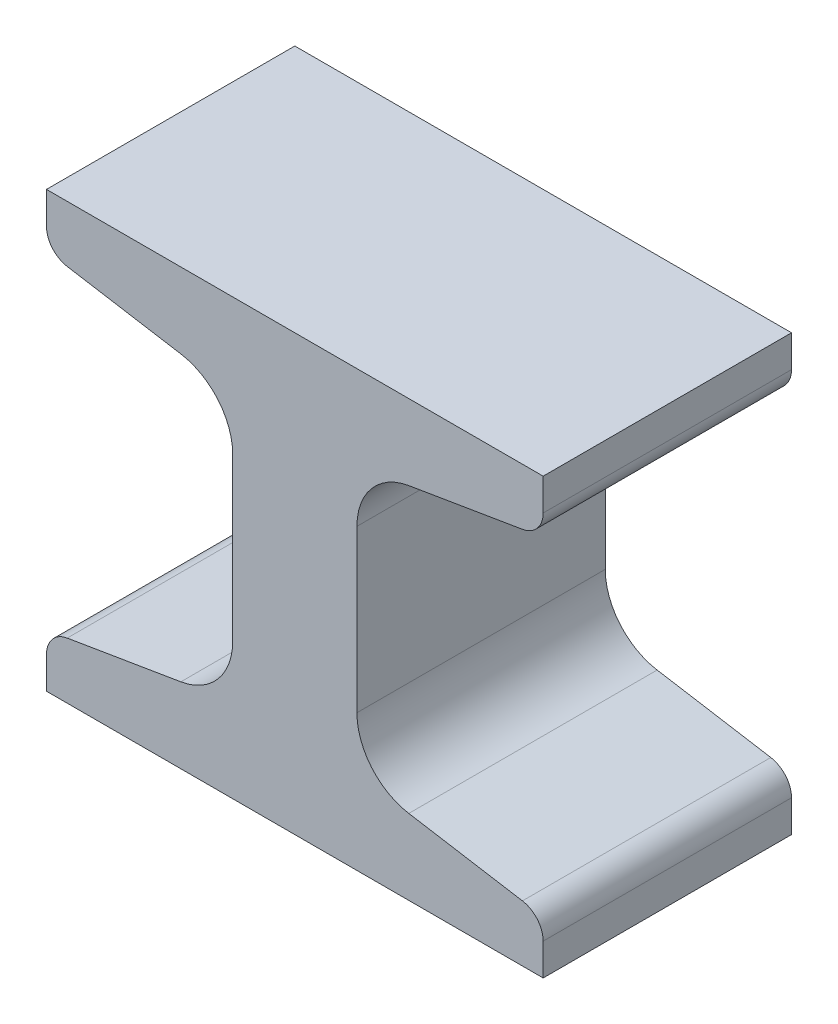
ISO-10303-21;
HEADER;
FILE_DESCRIPTION(('STEP AP214'),'2;1');
FILE_NAME('part.step','',(''),(''),'','','');
FILE_SCHEMA(('AUTOMOTIVE_DESIGN { 1 0 10303 214 1 1 1 1 }'));
ENDSEC;
DATA;
#1=APPLICATION_CONTEXT('core data for automotive mechanical design processes');
#2=APPLICATION_PROTOCOL_DEFINITION('international standard','automotive_design',2000,#1);
#3=PRODUCT_CONTEXT('',#1,'mechanical');
#4=PRODUCT('Part','Part','',(#3));
#5=PRODUCT_RELATED_PRODUCT_CATEGORY('part','',(#4));
#6=PRODUCT_DEFINITION_FORMATION('','',#4);
#7=PRODUCT_DEFINITION_CONTEXT('part definition',#1,'design');
#8=PRODUCT_DEFINITION('design','',#6,#7);
#9=PRODUCT_DEFINITION_SHAPE('','',#8);
#10=(LENGTH_UNIT() NAMED_UNIT(*) SI_UNIT(.MILLI.,.METRE.));
#11=(NAMED_UNIT(*) PLANE_ANGLE_UNIT() SI_UNIT($,.RADIAN.));
#12=(NAMED_UNIT(*) SI_UNIT($,.STERADIAN.) SOLID_ANGLE_UNIT());
#13=UNCERTAINTY_MEASURE_WITH_UNIT(LENGTH_MEASURE(1.E-05),#10,'distance_accuracy_value','');
#14=(GEOMETRIC_REPRESENTATION_CONTEXT(3) GLOBAL_UNCERTAINTY_ASSIGNED_CONTEXT((#13)) GLOBAL_UNIT_ASSIGNED_CONTEXT((#10,
#11,#12)) REPRESENTATION_CONTEXT('',''));
#15=CARTESIAN_POINT('',(0.,0.,0.));
#16=DIRECTION('',(0.,0.,1.));
#17=DIRECTION('',(1.,0.,0.));
#18=AXIS2_PLACEMENT_3D('',#15,#16,#17);
#19=CARTESIAN_POINT('',(50.8,0.,12.7));
#20=DIRECTION('',(0.,-1.,0.));
#21=DIRECTION('',(0.,0.,-1.));
#22=AXIS2_PLACEMENT_3D('',#19,#20,#21);
#23=PLANE('',#22);
#24=DIRECTION('',(-1.,0.,0.));
#25=VECTOR('',#24,1.);
#26=CARTESIAN_POINT('',(50.8,0.,-12.7));
#27=LINE('',#26,#25);
#28=CARTESIAN_POINT('',(50.8,0.,-12.7));
#29=VERTEX_POINT('',#28);
#30=CARTESIAN_POINT('',(0.,0.,-12.7));
#31=VERTEX_POINT('',#30);
#32=EDGE_CURVE('E208',#29,#31,#27,.T.);
#33=ORIENTED_EDGE('',*,*,#32,.F.);
#34=DIRECTION('',(0.,0.,-1.));
#35=VECTOR('',#34,1.);
#36=CARTESIAN_POINT('',(50.8,0.,12.7));
#37=LINE('',#36,#35);
#38=CARTESIAN_POINT('',(50.8,0.,12.7));
#39=VERTEX_POINT('',#38);
#40=EDGE_CURVE('E11',#39,#29,#37,.T.);
#41=ORIENTED_EDGE('',*,*,#40,.F.);
#42=DIRECTION('',(-1.,0.,0.));
#43=VECTOR('',#42,1.);
#44=CARTESIAN_POINT('',(50.8,0.,12.7));
#45=LINE('',#44,#43);
#46=CARTESIAN_POINT('',(0.,0.,12.7));
#47=VERTEX_POINT('',#46);
#48=EDGE_CURVE('E264',#39,#47,#45,.T.);
#49=ORIENTED_EDGE('',*,*,#48,.T.);
#50=DIRECTION('',(0.,0.,-1.));
#51=VECTOR('',#50,1.);
#52=CARTESIAN_POINT('',(0.,0.,12.7));
#53=LINE('',#52,#51);
#54=EDGE_CURVE('E42',#47,#31,#53,.T.);
#55=ORIENTED_EDGE('',*,*,#54,.T.);
#56=EDGE_LOOP('',(#33,#41,#49,#55));
#57=FACE_BOUND('',#56,.T.);
#58=ADVANCED_FACE('F39',(#57),#23,.T.);
#59=CARTESIAN_POINT('',(50.8,3.26452427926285,12.7));
#60=DIRECTION('',(1.,0.,0.));
#61=DIRECTION('',(0.,0.,-1.));
#62=AXIS2_PLACEMENT_3D('',#59,#60,#61);
#63=PLANE('',#62);
#64=DIRECTION('',(0.,-1.,0.));
#65=VECTOR('',#64,1.);
#66=CARTESIAN_POINT('',(50.8,3.26452427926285,-12.7));
#67=LINE('',#66,#65);
#68=CARTESIAN_POINT('',(50.8,3.26452427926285,-12.7));
#69=VERTEX_POINT('',#68);
#70=EDGE_CURVE('E262',#69,#29,#67,.T.);
#71=ORIENTED_EDGE('',*,*,#70,.F.);
#72=DIRECTION('',(0.,0.,-1.));
#73=VECTOR('',#72,1.);
#74=CARTESIAN_POINT('',(50.8,3.26452427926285,12.7));
#75=LINE('',#74,#73);
#76=CARTESIAN_POINT('',(50.8,3.26452427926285,12.7));
#77=VERTEX_POINT('',#76);
#78=EDGE_CURVE('E48',#77,#69,#75,.T.);
#79=ORIENTED_EDGE('',*,*,#78,.F.);
#80=DIRECTION('',(0.,-1.,0.));
#81=VECTOR('',#80,1.);
#82=CARTESIAN_POINT('',(50.8,3.26452427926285,12.7));
#83=LINE('',#82,#81);
#84=EDGE_CURVE('E198',#77,#39,#83,.T.);
#85=ORIENTED_EDGE('',*,*,#84,.T.);
#86=ORIENTED_EDGE('',*,*,#40,.T.);
#87=EDGE_LOOP('',(#71,#79,#85,#86));
#88=FACE_BOUND('',#87,.T.);
#89=ADVANCED_FACE('F301',(#88),#63,.T.);
#90=CARTESIAN_POINT('',(48.26,3.26452427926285,12.7));
#91=DIRECTION('',(0.,0.,-1.));
#92=DIRECTION('',(-1.,0.,0.));
#93=AXIS2_PLACEMENT_3D('',#90,#91,#92);
#94=CYLINDRICAL_SURFACE('',#93,2.54);
#95=CARTESIAN_POINT('',(48.26,3.26452427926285,-12.7));
#96=DIRECTION('',(0.,0.,-1.));
#97=DIRECTION('',(-1.,0.,0.));
#98=AXIS2_PLACEMENT_3D('',#95,#96,#97);
#99=CIRCLE('',#98,2.54);
#100=CARTESIAN_POINT('',(48.6774718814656,5.76998176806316,-12.7));
#101=VERTEX_POINT('',#100);
#102=EDGE_CURVE('E185',#101,#69,#99,.T.);
#103=ORIENTED_EDGE('',*,*,#102,.F.);
#104=DIRECTION('',(0.,0.,-1.));
#105=VECTOR('',#104,1.);
#106=CARTESIAN_POINT('',(48.6774718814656,5.76998176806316,12.7));
#107=LINE('',#106,#105);
#108=CARTESIAN_POINT('',(48.6774718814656,5.76998176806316,12.7));
#109=VERTEX_POINT('',#108);
#110=EDGE_CURVE('E180',#109,#101,#107,.T.);
#111=ORIENTED_EDGE('',*,*,#110,.F.);
#112=CARTESIAN_POINT('',(48.26,3.26452427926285,12.7));
#113=DIRECTION('',(0.,0.,-1.));
#114=DIRECTION('',(-1.,0.,0.));
#115=AXIS2_PLACEMENT_3D('',#112,#113,#114);
#116=CIRCLE('',#115,2.54);
#117=EDGE_CURVE('E183',#109,#77,#116,.T.);
#118=ORIENTED_EDGE('',*,*,#117,.T.);
#119=ORIENTED_EDGE('',*,*,#78,.T.);
#120=EDGE_LOOP('',(#103,#111,#118,#119));
#121=FACE_BOUND('',#120,.T.);
#122=ADVANCED_FACE('F182',(#121),#94,.T.);
#123=CARTESIAN_POINT('',(37.056320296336,7.70635627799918,12.7));
#124=DIRECTION('',(0.164359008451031,0.986400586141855,0.));
#125=DIRECTION('',(-0.986400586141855,0.164359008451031,0.));
#126=AXIS2_PLACEMENT_3D('',#123,#124,#125);
#127=PLANE('',#126);
#128=DIRECTION('',(0.986400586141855,-0.164359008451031,0.));
#129=VECTOR('',#128,1.);
#130=CARTESIAN_POINT('',(37.056320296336,7.70635627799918,-12.7));
#131=LINE('',#130,#129);
#132=CARTESIAN_POINT('',(37.056320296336,7.70635627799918,-12.7));
#133=VERTEX_POINT('',#132);
#134=EDGE_CURVE('E259',#133,#101,#131,.T.);
#135=ORIENTED_EDGE('',*,*,#134,.F.);
#136=DIRECTION('',(0.,0.,-1.));
#137=VECTOR('',#136,1.);
#138=CARTESIAN_POINT('',(37.056320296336,7.70635627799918,12.7));
#139=LINE('',#138,#137);
#140=CARTESIAN_POINT('',(37.056320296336,7.70635627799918,12.7));
#141=VERTEX_POINT('',#140);
#142=EDGE_CURVE('E190',#141,#133,#139,.T.);
#143=ORIENTED_EDGE('',*,*,#142,.F.);
#144=DIRECTION('',(0.986400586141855,-0.164359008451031,0.));
#145=VECTOR('',#144,1.);
#146=CARTESIAN_POINT('',(37.056320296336,7.70635627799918,12.7));
#147=LINE('',#146,#145);
#148=EDGE_CURVE('E196',#141,#109,#147,.T.);
#149=ORIENTED_EDGE('',*,*,#148,.T.);
#150=ORIENTED_EDGE('',*,*,#110,.T.);
#151=EDGE_LOOP('',(#135,#143,#149,#150));
#152=FACE_BOUND('',#151,.T.);
#153=ADVANCED_FACE('F200',(#152),#127,.T.);
#154=CARTESIAN_POINT('',(38.1,13.97,12.7));
#155=DIRECTION('',(0.,0.,-1.));
#156=DIRECTION('',(-1.,0.,0.));
#157=AXIS2_PLACEMENT_3D('',#154,#155,#156);
#158=CYLINDRICAL_SURFACE('',#157,6.35);
#159=CARTESIAN_POINT('',(38.1,13.97,-12.7));
#160=DIRECTION('',(0.,0.,1.));
#161=DIRECTION('',(1.,0.,0.));
#162=AXIS2_PLACEMENT_3D('',#159,#160,#161);
#163=CIRCLE('',#162,6.35);
#164=CARTESIAN_POINT('',(31.75,13.97,-12.7));
#165=VERTEX_POINT('',#164);
#166=EDGE_CURVE('E256',#165,#133,#163,.T.);
#167=ORIENTED_EDGE('',*,*,#166,.F.);
#168=DIRECTION('',(0.,0.,-1.));
#169=VECTOR('',#168,1.);
#170=CARTESIAN_POINT('',(31.75,13.97,12.7));
#171=LINE('',#170,#169);
#172=CARTESIAN_POINT('',(31.75,13.97,12.7));
#173=VERTEX_POINT('',#172);
#174=EDGE_CURVE('E268',#173,#165,#171,.T.);
#175=ORIENTED_EDGE('',*,*,#174,.F.);
#176=CARTESIAN_POINT('',(38.1,13.97,12.7));
#177=DIRECTION('',(0.,0.,1.));
#178=DIRECTION('',(1.,0.,0.));
#179=AXIS2_PLACEMENT_3D('',#176,#177,#178);
#180=CIRCLE('',#179,6.35);
#181=EDGE_CURVE('E201',#173,#141,#180,.T.);
#182=ORIENTED_EDGE('',*,*,#181,.T.);
#183=ORIENTED_EDGE('',*,*,#142,.T.);
#184=EDGE_LOOP('',(#167,#175,#182,#183));
#185=FACE_BOUND('',#184,.T.);
#186=ADVANCED_FACE('F314',(#185),#158,.F.);
#187=CARTESIAN_POINT('',(31.75,30.48,12.7));
#188=DIRECTION('',(1.,0.,0.));
#189=DIRECTION('',(0.,0.,-1.));
#190=AXIS2_PLACEMENT_3D('',#187,#188,#189);
#191=PLANE('',#190);
#192=DIRECTION('',(0.,-1.,0.));
#193=VECTOR('',#192,1.);
#194=CARTESIAN_POINT('',(31.75,30.48,-12.7));
#195=LINE('',#194,#193);
#196=CARTESIAN_POINT('',(31.75,30.48,-12.7));
#197=VERTEX_POINT('',#196);
#198=EDGE_CURVE('E253',#197,#165,#195,.T.);
#199=ORIENTED_EDGE('',*,*,#198,.F.);
#200=DIRECTION('',(0.,0.,-1.));
#201=VECTOR('',#200,1.);
#202=CARTESIAN_POINT('',(31.75,30.48,12.7));
#203=LINE('',#202,#201);
#204=CARTESIAN_POINT('',(31.75,30.48,12.7));
#205=VERTEX_POINT('',#204);
#206=EDGE_CURVE('E270',#205,#197,#203,.T.);
#207=ORIENTED_EDGE('',*,*,#206,.F.);
#208=DIRECTION('',(0.,-1.,0.));
#209=VECTOR('',#208,1.);
#210=CARTESIAN_POINT('',(31.75,30.48,12.7));
#211=LINE('',#210,#209);
#212=EDGE_CURVE('E203',#205,#173,#211,.T.);
#213=ORIENTED_EDGE('',*,*,#212,.T.);
#214=ORIENTED_EDGE('',*,*,#174,.T.);
#215=EDGE_LOOP('',(#199,#207,#213,#214));
#216=FACE_BOUND('',#215,.T.);
#217=ADVANCED_FACE('F317',(#216),#191,.T.);
#218=CARTESIAN_POINT('',(38.1,30.48,12.7));
#219=DIRECTION('',(0.,0.,-1.));
#220=DIRECTION('',(-1.,0.,0.));
#221=AXIS2_PLACEMENT_3D('',#218,#219,#220);
#222=CYLINDRICAL_SURFACE('',#221,6.35);
#223=CARTESIAN_POINT('',(38.1,30.48,-12.7));
#224=DIRECTION('',(0.,0.,1.));
#225=DIRECTION('',(1.,0.,0.));
#226=AXIS2_PLACEMENT_3D('',#223,#224,#225);
#227=CIRCLE('',#226,6.35);
#228=CARTESIAN_POINT('',(37.0563202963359,36.7436437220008,-12.7));
#229=VERTEX_POINT('',#228);
#230=EDGE_CURVE('E250',#229,#197,#227,.T.);
#231=ORIENTED_EDGE('',*,*,#230,.F.);
#232=DIRECTION('',(0.,0.,-1.));
#233=VECTOR('',#232,1.);
#234=CARTESIAN_POINT('',(37.0563202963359,36.7436437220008,12.7));
#235=LINE('',#234,#233);
#236=CARTESIAN_POINT('',(37.0563202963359,36.7436437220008,12.7));
#237=VERTEX_POINT('',#236);
#238=EDGE_CURVE('E272',#237,#229,#235,.T.);
#239=ORIENTED_EDGE('',*,*,#238,.F.);
#240=CARTESIAN_POINT('',(38.1,30.48,12.7));
#241=DIRECTION('',(0.,0.,1.));
#242=DIRECTION('',(1.,0.,0.));
#243=AXIS2_PLACEMENT_3D('',#240,#241,#242);
#244=CIRCLE('',#243,6.35);
#245=EDGE_CURVE('E552',#237,#205,#244,.T.);
#246=ORIENTED_EDGE('',*,*,#245,.T.);
#247=ORIENTED_EDGE('',*,*,#206,.T.);
#248=EDGE_LOOP('',(#231,#239,#246,#247));
#249=FACE_BOUND('',#248,.T.);
#250=ADVANCED_FACE('F321',(#249),#222,.F.);
#251=CARTESIAN_POINT('',(48.6774718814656,38.6800182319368,12.7));
#252=DIRECTION('',(0.164359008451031,-0.986400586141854,0.));
#253=DIRECTION('',(0.986400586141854,0.164359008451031,0.));
#254=AXIS2_PLACEMENT_3D('',#251,#252,#253);
#255=PLANE('',#254);
#256=DIRECTION('',(-0.986400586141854,-0.164359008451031,0.));
#257=VECTOR('',#256,1.);
#258=CARTESIAN_POINT('',(48.6774718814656,38.6800182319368,-12.7));
#259=LINE('',#258,#257);
#260=CARTESIAN_POINT('',(48.6774718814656,38.6800182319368,-12.7));
#261=VERTEX_POINT('',#260);
#262=EDGE_CURVE('E247',#261,#229,#259,.T.);
#263=ORIENTED_EDGE('',*,*,#262,.F.);
#264=DIRECTION('',(0.,0.,-1.));
#265=VECTOR('',#264,1.);
#266=CARTESIAN_POINT('',(48.6774718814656,38.6800182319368,12.7));
#267=LINE('',#266,#265);
#268=CARTESIAN_POINT('',(48.6774718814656,38.6800182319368,12.7));
#269=VERTEX_POINT('',#268);
#270=EDGE_CURVE('E274',#269,#261,#267,.T.);
#271=ORIENTED_EDGE('',*,*,#270,.F.);
#272=DIRECTION('',(-0.986400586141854,-0.164359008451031,0.));
#273=VECTOR('',#272,1.);
#274=CARTESIAN_POINT('',(48.6774718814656,38.6800182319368,12.7));
#275=LINE('',#274,#273);
#276=EDGE_CURVE('E547',#269,#237,#275,.T.);
#277=ORIENTED_EDGE('',*,*,#276,.T.);
#278=ORIENTED_EDGE('',*,*,#238,.T.);
#279=EDGE_LOOP('',(#263,#271,#277,#278));
#280=FACE_BOUND('',#279,.T.);
#281=ADVANCED_FACE('F325',(#280),#255,.T.);
#282=CARTESIAN_POINT('',(48.26,41.1854757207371,12.7));
#283=DIRECTION('',(0.,0.,-1.));
#284=DIRECTION('',(-1.,0.,0.));
#285=AXIS2_PLACEMENT_3D('',#282,#283,#284);
#286=CYLINDRICAL_SURFACE('',#285,2.54);
#287=CARTESIAN_POINT('',(48.26,41.1854757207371,-12.7));
#288=DIRECTION('',(0.,0.,1.));
#289=DIRECTION('',(1.,0.,0.));
#290=AXIS2_PLACEMENT_3D('',#287,#288,#289);
#291=CIRCLE('',#290,2.54);
#292=CARTESIAN_POINT('',(50.8,41.1854757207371,-12.7));
#293=VERTEX_POINT('',#292);
#294=EDGE_CURVE('E244',#261,#293,#291,.T.);
#295=ORIENTED_EDGE('',*,*,#294,.T.);
#296=DIRECTION('',(0.,0.,-1.));
#297=VECTOR('',#296,1.);
#298=CARTESIAN_POINT('',(50.8,41.1854757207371,12.7));
#299=LINE('',#298,#297);
#300=CARTESIAN_POINT('',(50.8,41.1854757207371,12.7));
#301=VERTEX_POINT('',#300);
#302=EDGE_CURVE('E276',#301,#293,#299,.T.);
#303=ORIENTED_EDGE('',*,*,#302,.F.);
#304=CARTESIAN_POINT('',(48.26,41.1854757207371,12.7));
#305=DIRECTION('',(0.,0.,1.));
#306=DIRECTION('',(1.,0.,0.));
#307=AXIS2_PLACEMENT_3D('',#304,#305,#306);
#308=CIRCLE('',#307,2.54);
#309=EDGE_CURVE('E544',#269,#301,#308,.T.);
#310=ORIENTED_EDGE('',*,*,#309,.F.);
#311=ORIENTED_EDGE('',*,*,#270,.T.);
#312=EDGE_LOOP('',(#295,#303,#310,#311));
#313=FACE_BOUND('',#312,.T.);
#314=ADVANCED_FACE('F329',(#313),#286,.T.);
#315=CARTESIAN_POINT('',(50.8,44.45,12.7));
#316=DIRECTION('',(1.,0.,0.));
#317=DIRECTION('',(0.,0.,-1.));
#318=AXIS2_PLACEMENT_3D('',#315,#316,#317);
#319=PLANE('',#318);
#320=DIRECTION('',(0.,-1.,0.));
#321=VECTOR('',#320,1.);
#322=CARTESIAN_POINT('',(50.8,44.45,-12.7));
#323=LINE('',#322,#321);
#324=CARTESIAN_POINT('',(50.8,44.45,-12.7));
#325=VERTEX_POINT('',#324);
#326=EDGE_CURVE('E241',#325,#293,#323,.T.);
#327=ORIENTED_EDGE('',*,*,#326,.F.);
#328=DIRECTION('',(0.,0.,-1.));
#329=VECTOR('',#328,1.);
#330=CARTESIAN_POINT('',(50.8,44.45,12.7));
#331=LINE('',#330,#329);
#332=CARTESIAN_POINT('',(50.8,44.45,12.7));
#333=VERTEX_POINT('',#332);
#334=EDGE_CURVE('E278',#333,#325,#331,.T.);
#335=ORIENTED_EDGE('',*,*,#334,.F.);
#336=DIRECTION('',(0.,-1.,0.));
#337=VECTOR('',#336,1.);
#338=CARTESIAN_POINT('',(50.8,44.45,12.7));
#339=LINE('',#338,#337);
#340=EDGE_CURVE('E542',#333,#301,#339,.T.);
#341=ORIENTED_EDGE('',*,*,#340,.T.);
#342=ORIENTED_EDGE('',*,*,#302,.T.);
#343=EDGE_LOOP('',(#327,#335,#341,#342));
#344=FACE_BOUND('',#343,.T.);
#345=ADVANCED_FACE('F333',(#344),#319,.T.);
#346=CARTESIAN_POINT('',(0.,44.45,12.7));
#347=DIRECTION('',(0.,1.,0.));
#348=DIRECTION('',(0.,0.,1.));
#349=AXIS2_PLACEMENT_3D('',#346,#347,#348);
#350=PLANE('',#349);
#351=DIRECTION('',(1.,0.,0.));
#352=VECTOR('',#351,1.);
#353=CARTESIAN_POINT('',(0.,44.45,-12.7));
#354=LINE('',#353,#352);
#355=CARTESIAN_POINT('',(0.,44.45,-12.7));
#356=VERTEX_POINT('',#355);
#357=EDGE_CURVE('E238',#356,#325,#354,.T.);
#358=ORIENTED_EDGE('',*,*,#357,.F.);
#359=DIRECTION('',(0.,0.,-1.));
#360=VECTOR('',#359,1.);
#361=CARTESIAN_POINT('',(0.,44.45,12.7));
#362=LINE('',#361,#360);
#363=CARTESIAN_POINT('',(0.,44.45,12.7));
#364=VERTEX_POINT('',#363);
#365=EDGE_CURVE('E280',#364,#356,#362,.T.);
#366=ORIENTED_EDGE('',*,*,#365,.F.);
#367=DIRECTION('',(1.,0.,0.));
#368=VECTOR('',#367,1.);
#369=CARTESIAN_POINT('',(0.,44.45,12.7));
#370=LINE('',#369,#368);
#371=EDGE_CURVE('E561',#364,#333,#370,.T.);
#372=ORIENTED_EDGE('',*,*,#371,.T.);
#373=ORIENTED_EDGE('',*,*,#334,.T.);
#374=EDGE_LOOP('',(#358,#366,#372,#373));
#375=FACE_BOUND('',#374,.T.);
#376=ADVANCED_FACE('F337',(#375),#350,.T.);
#377=CARTESIAN_POINT('',(0.,41.1854757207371,12.7));
#378=DIRECTION('',(-1.,0.,0.));
#379=DIRECTION('',(0.,-1.,0.));
#380=AXIS2_PLACEMENT_3D('',#377,#378,#379);
#381=PLANE('',#380);
#382=DIRECTION('',(0.,1.,0.));
#383=VECTOR('',#382,1.);
#384=CARTESIAN_POINT('',(0.,41.1854757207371,-12.7));
#385=LINE('',#384,#383);
#386=CARTESIAN_POINT('',(0.,41.1854757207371,-12.7));
#387=VERTEX_POINT('',#386);
#388=EDGE_CURVE('E235',#387,#356,#385,.T.);
#389=ORIENTED_EDGE('',*,*,#388,.F.);
#390=DIRECTION('',(0.,0.,-1.));
#391=VECTOR('',#390,1.);
#392=CARTESIAN_POINT('',(0.,41.1854757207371,12.7));
#393=LINE('',#392,#391);
#394=CARTESIAN_POINT('',(0.,41.1854757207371,12.7));
#395=VERTEX_POINT('',#394);
#396=EDGE_CURVE('E282',#395,#387,#393,.T.);
#397=ORIENTED_EDGE('',*,*,#396,.F.);
#398=DIRECTION('',(0.,1.,0.));
#399=VECTOR('',#398,1.);
#400=CARTESIAN_POINT('',(0.,41.1854757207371,12.7));
#401=LINE('',#400,#399);
#402=EDGE_CURVE('E533',#395,#364,#401,.T.);
#403=ORIENTED_EDGE('',*,*,#402,.T.);
#404=ORIENTED_EDGE('',*,*,#365,.T.);
#405=EDGE_LOOP('',(#389,#397,#403,#404));
#406=FACE_BOUND('',#405,.T.);
#407=ADVANCED_FACE('F341',(#406),#381,.T.);
#408=CARTESIAN_POINT('',(2.54,41.1854757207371,12.7));
#409=DIRECTION('',(0.,0.,-1.));
#410=DIRECTION('',(-1.,0.,0.));
#411=AXIS2_PLACEMENT_3D('',#408,#409,#410);
#412=CYLINDRICAL_SURFACE('',#411,2.54);
#413=CARTESIAN_POINT('',(2.54,41.1854757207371,-12.7));
#414=DIRECTION('',(0.,0.,-1.));
#415=DIRECTION('',(-1.,0.,0.));
#416=AXIS2_PLACEMENT_3D('',#413,#414,#415);
#417=CIRCLE('',#416,2.54);
#418=CARTESIAN_POINT('',(2.12252811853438,38.6800182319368,-12.7));
#419=VERTEX_POINT('',#418);
#420=EDGE_CURVE('E232',#419,#387,#417,.T.);
#421=ORIENTED_EDGE('',*,*,#420,.F.);
#422=DIRECTION('',(0.,0.,-1.));
#423=VECTOR('',#422,1.);
#424=CARTESIAN_POINT('',(2.12252811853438,38.6800182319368,12.7));
#425=LINE('',#424,#423);
#426=CARTESIAN_POINT('',(2.12252811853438,38.6800182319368,12.7));
#427=VERTEX_POINT('',#426);
#428=EDGE_CURVE('E284',#427,#419,#425,.T.);
#429=ORIENTED_EDGE('',*,*,#428,.F.);
#430=CARTESIAN_POINT('',(2.54,41.1854757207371,12.7));
#431=DIRECTION('',(0.,0.,-1.));
#432=DIRECTION('',(-1.,0.,0.));
#433=AXIS2_PLACEMENT_3D('',#430,#431,#432);
#434=CIRCLE('',#433,2.54);
#435=EDGE_CURVE('E529',#427,#395,#434,.T.);
#436=ORIENTED_EDGE('',*,*,#435,.T.);
#437=ORIENTED_EDGE('',*,*,#396,.T.);
#438=EDGE_LOOP('',(#421,#429,#436,#437));
#439=FACE_BOUND('',#438,.T.);
#440=ADVANCED_FACE('F345',(#439),#412,.T.);
#441=CARTESIAN_POINT('',(13.743679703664,36.7436437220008,12.7));
#442=DIRECTION('',(-0.164359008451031,-0.986400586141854,0.));
#443=DIRECTION('',(0.986400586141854,-0.164359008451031,0.));
#444=AXIS2_PLACEMENT_3D('',#441,#442,#443);
#445=PLANE('',#444);
#446=DIRECTION('',(-0.986400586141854,0.164359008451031,0.));
#447=VECTOR('',#446,1.);
#448=CARTESIAN_POINT('',(13.743679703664,36.7436437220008,-12.7));
#449=LINE('',#448,#447);
#450=CARTESIAN_POINT('',(13.743679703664,36.7436437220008,-12.7));
#451=VERTEX_POINT('',#450);
#452=EDGE_CURVE('E229',#451,#419,#449,.T.);
#453=ORIENTED_EDGE('',*,*,#452,.F.);
#454=DIRECTION('',(0.,0.,-1.));
#455=VECTOR('',#454,1.);
#456=CARTESIAN_POINT('',(13.743679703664,36.7436437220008,12.7));
#457=LINE('',#456,#455);
#458=CARTESIAN_POINT('',(13.743679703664,36.7436437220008,12.7));
#459=VERTEX_POINT('',#458);
#460=EDGE_CURVE('E286',#459,#451,#457,.T.);
#461=ORIENTED_EDGE('',*,*,#460,.F.);
#462=DIRECTION('',(-0.986400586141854,0.164359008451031,0.));
#463=VECTOR('',#462,1.);
#464=CARTESIAN_POINT('',(13.743679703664,36.7436437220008,12.7));
#465=LINE('',#464,#463);
#466=EDGE_CURVE('E565',#459,#427,#465,.T.);
#467=ORIENTED_EDGE('',*,*,#466,.T.);
#468=ORIENTED_EDGE('',*,*,#428,.T.);
#469=EDGE_LOOP('',(#453,#461,#467,#468));
#470=FACE_BOUND('',#469,.T.);
#471=ADVANCED_FACE('F349',(#470),#445,.T.);
#472=CARTESIAN_POINT('',(12.7,30.48,12.7));
#473=DIRECTION('',(0.,0.,-1.));
#474=DIRECTION('',(-1.,0.,0.));
#475=AXIS2_PLACEMENT_3D('',#472,#473,#474);
#476=CYLINDRICAL_SURFACE('',#475,6.35);
#477=CARTESIAN_POINT('',(12.7,30.48,-12.7));
#478=DIRECTION('',(0.,0.,1.));
#479=DIRECTION('',(1.,0.,0.));
#480=AXIS2_PLACEMENT_3D('',#477,#478,#479);
#481=CIRCLE('',#480,6.35);
#482=CARTESIAN_POINT('',(19.05,30.48,-12.7));
#483=VERTEX_POINT('',#482);
#484=EDGE_CURVE('E226',#483,#451,#481,.T.);
#485=ORIENTED_EDGE('',*,*,#484,.F.);
#486=DIRECTION('',(0.,0.,-1.));
#487=VECTOR('',#486,1.);
#488=CARTESIAN_POINT('',(19.05,30.48,12.7));
#489=LINE('',#488,#487);
#490=CARTESIAN_POINT('',(19.05,30.48,12.7));
#491=VERTEX_POINT('',#490);
#492=EDGE_CURVE('E288',#491,#483,#489,.T.);
#493=ORIENTED_EDGE('',*,*,#492,.F.);
#494=CARTESIAN_POINT('',(12.7,30.48,12.7));
#495=DIRECTION('',(0.,0.,1.));
#496=DIRECTION('',(1.,0.,0.));
#497=AXIS2_PLACEMENT_3D('',#494,#495,#496);
#498=CIRCLE('',#497,6.35);
#499=EDGE_CURVE('E522',#491,#459,#498,.T.);
#500=ORIENTED_EDGE('',*,*,#499,.T.);
#501=ORIENTED_EDGE('',*,*,#460,.T.);
#502=EDGE_LOOP('',(#485,#493,#500,#501));
#503=FACE_BOUND('',#502,.T.);
#504=ADVANCED_FACE('F353',(#503),#476,.F.);
#505=CARTESIAN_POINT('',(19.05,13.97,12.7));
#506=DIRECTION('',(-1.,0.,0.));
#507=DIRECTION('',(0.,0.,1.));
#508=AXIS2_PLACEMENT_3D('',#505,#506,#507);
#509=PLANE('',#508);
#510=DIRECTION('',(0.,1.,0.));
#511=VECTOR('',#510,1.);
#512=CARTESIAN_POINT('',(19.05,13.97,-12.7));
#513=LINE('',#512,#511);
#514=CARTESIAN_POINT('',(19.05,13.97,-12.7));
#515=VERTEX_POINT('',#514);
#516=EDGE_CURVE('E223',#515,#483,#513,.T.);
#517=ORIENTED_EDGE('',*,*,#516,.F.);
#518=DIRECTION('',(0.,0.,-1.));
#519=VECTOR('',#518,1.);
#520=CARTESIAN_POINT('',(19.05,13.97,12.7));
#521=LINE('',#520,#519);
#522=CARTESIAN_POINT('',(19.05,13.97,12.7));
#523=VERTEX_POINT('',#522);
#524=EDGE_CURVE('E290',#523,#515,#521,.T.);
#525=ORIENTED_EDGE('',*,*,#524,.F.);
#526=DIRECTION('',(0.,1.,0.));
#527=VECTOR('',#526,1.);
#528=CARTESIAN_POINT('',(19.05,13.97,12.7));
#529=LINE('',#528,#527);
#530=EDGE_CURVE('E518',#523,#491,#529,.T.);
#531=ORIENTED_EDGE('',*,*,#530,.T.);
#532=ORIENTED_EDGE('',*,*,#492,.T.);
#533=EDGE_LOOP('',(#517,#525,#531,#532));
#534=FACE_BOUND('',#533,.T.);
#535=ADVANCED_FACE('F357',(#534),#509,.T.);
#536=CARTESIAN_POINT('',(12.7,13.97,12.7));
#537=DIRECTION('',(0.,0.,-1.));
#538=DIRECTION('',(-1.,0.,0.));
#539=AXIS2_PLACEMENT_3D('',#536,#537,#538);
#540=CYLINDRICAL_SURFACE('',#539,6.35);
#541=CARTESIAN_POINT('',(12.7,13.97,-12.7));
#542=DIRECTION('',(0.,0.,1.));
#543=DIRECTION('',(1.,0.,0.));
#544=AXIS2_PLACEMENT_3D('',#541,#542,#543);
#545=CIRCLE('',#544,6.35);
#546=CARTESIAN_POINT('',(13.743679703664,7.70635627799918,-12.7));
#547=VERTEX_POINT('',#546);
#548=EDGE_CURVE('E220',#547,#515,#545,.T.);
#549=ORIENTED_EDGE('',*,*,#548,.F.);
#550=DIRECTION('',(0.,0.,-1.));
#551=VECTOR('',#550,1.);
#552=CARTESIAN_POINT('',(13.743679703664,7.70635627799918,12.7));
#553=LINE('',#552,#551);
#554=CARTESIAN_POINT('',(13.743679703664,7.70635627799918,12.7));
#555=VERTEX_POINT('',#554);
#556=EDGE_CURVE('E292',#555,#547,#553,.T.);
#557=ORIENTED_EDGE('',*,*,#556,.F.);
#558=CARTESIAN_POINT('',(12.7,13.97,12.7));
#559=DIRECTION('',(0.,0.,1.));
#560=DIRECTION('',(1.,0.,0.));
#561=AXIS2_PLACEMENT_3D('',#558,#559,#560);
#562=CIRCLE('',#561,6.35);
#563=EDGE_CURVE('E569',#555,#523,#562,.T.);
#564=ORIENTED_EDGE('',*,*,#563,.T.);
#565=ORIENTED_EDGE('',*,*,#524,.T.);
#566=EDGE_LOOP('',(#549,#557,#564,#565));
#567=FACE_BOUND('',#566,.T.);
#568=ADVANCED_FACE('F361',(#567),#540,.F.);
#569=CARTESIAN_POINT('',(2.12252811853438,5.76998176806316,12.7));
#570=DIRECTION('',(-0.164359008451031,0.986400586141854,0.));
#571=DIRECTION('',(-0.986400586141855,-0.164359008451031,0.));
#572=AXIS2_PLACEMENT_3D('',#569,#570,#571);
#573=PLANE('',#572);
#574=DIRECTION('',(0.986400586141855,0.164359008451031,0.));
#575=VECTOR('',#574,1.);
#576=CARTESIAN_POINT('',(2.12252811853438,5.76998176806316,-12.7));
#577=LINE('',#576,#575);
#578=CARTESIAN_POINT('',(2.12252811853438,5.76998176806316,-12.7));
#579=VERTEX_POINT('',#578);
#580=EDGE_CURVE('E217',#579,#547,#577,.T.);
#581=ORIENTED_EDGE('',*,*,#580,.F.);
#582=DIRECTION('',(0.,0.,-1.));
#583=VECTOR('',#582,1.);
#584=CARTESIAN_POINT('',(2.12252811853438,5.76998176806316,12.7));
#585=LINE('',#584,#583);
#586=CARTESIAN_POINT('',(2.12252811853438,5.76998176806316,12.7));
#587=VERTEX_POINT('',#586);
#588=EDGE_CURVE('E294',#587,#579,#585,.T.);
#589=ORIENTED_EDGE('',*,*,#588,.F.);
#590=DIRECTION('',(0.986400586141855,0.164359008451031,0.));
#591=VECTOR('',#590,1.);
#592=CARTESIAN_POINT('',(2.12252811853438,5.76998176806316,12.7));
#593=LINE('',#592,#591);
#594=EDGE_CURVE('E511',#587,#555,#593,.T.);
#595=ORIENTED_EDGE('',*,*,#594,.T.);
#596=ORIENTED_EDGE('',*,*,#556,.T.);
#597=EDGE_LOOP('',(#581,#589,#595,#596));
#598=FACE_BOUND('',#597,.T.);
#599=ADVANCED_FACE('F365',(#598),#573,.T.);
#600=CARTESIAN_POINT('',(2.54,3.26452427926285,12.7));
#601=DIRECTION('',(0.,0.,-1.));
#602=DIRECTION('',(-1.,0.,0.));
#603=AXIS2_PLACEMENT_3D('',#600,#601,#602);
#604=CYLINDRICAL_SURFACE('',#603,2.54);
#605=CARTESIAN_POINT('',(2.54,3.26452427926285,-12.7));
#606=DIRECTION('',(0.,0.,1.));
#607=DIRECTION('',(1.,0.,0.));
#608=AXIS2_PLACEMENT_3D('',#605,#606,#607);
#609=CIRCLE('',#608,2.54);
#610=CARTESIAN_POINT('',(0.,3.26452427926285,-12.7));
#611=VERTEX_POINT('',#610);
#612=EDGE_CURVE('E214',#579,#611,#609,.T.);
#613=ORIENTED_EDGE('',*,*,#612,.T.);
#614=DIRECTION('',(0.,0.,-1.));
#615=VECTOR('',#614,1.);
#616=CARTESIAN_POINT('',(0.,3.26452427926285,12.7));
#617=LINE('',#616,#615);
#618=CARTESIAN_POINT('',(0.,3.26452427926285,12.7));
#619=VERTEX_POINT('',#618);
#620=EDGE_CURVE('E295',#619,#611,#617,.T.);
#621=ORIENTED_EDGE('',*,*,#620,.F.);
#622=CARTESIAN_POINT('',(2.54,3.26452427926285,12.7));
#623=DIRECTION('',(0.,0.,1.));
#624=DIRECTION('',(1.,0.,0.));
#625=AXIS2_PLACEMENT_3D('',#622,#623,#624);
#626=CIRCLE('',#625,2.54);
#627=EDGE_CURVE('E572',#587,#619,#626,.T.);
#628=ORIENTED_EDGE('',*,*,#627,.F.);
#629=ORIENTED_EDGE('',*,*,#588,.T.);
#630=EDGE_LOOP('',(#613,#621,#628,#629));
#631=FACE_BOUND('',#630,.T.);
#632=ADVANCED_FACE('F369',(#631),#604,.T.);
#633=CARTESIAN_POINT('',(0.,0.,12.7));
#634=DIRECTION('',(-1.,0.,0.));
#635=DIRECTION('',(0.,-1.,0.));
#636=AXIS2_PLACEMENT_3D('',#633,#634,#635);
#637=PLANE('',#636);
#638=DIRECTION('',(0.,1.,0.));
#639=VECTOR('',#638,1.);
#640=CARTESIAN_POINT('',(0.,0.,-12.7));
#641=LINE('',#640,#639);
#642=EDGE_CURVE('E211',#31,#611,#641,.T.);
#643=ORIENTED_EDGE('',*,*,#642,.F.);
#644=ORIENTED_EDGE('',*,*,#54,.F.);
#645=DIRECTION('',(0.,1.,0.));
#646=VECTOR('',#645,1.);
#647=CARTESIAN_POINT('',(0.,0.,12.7));
#648=LINE('',#647,#646);
#649=EDGE_CURVE('E574',#47,#619,#648,.T.);
#650=ORIENTED_EDGE('',*,*,#649,.T.);
#651=ORIENTED_EDGE('',*,*,#620,.T.);
#652=EDGE_LOOP('',(#643,#644,#650,#651));
#653=FACE_BOUND('',#652,.T.);
#654=ADVANCED_FACE('F297',(#653),#637,.T.);
#655=CARTESIAN_POINT('',(2.54,3.26452427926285,12.7));
#656=DIRECTION('',(0.,0.,1.));
#657=DIRECTION('',(1.,0.,0.));
#658=AXIS2_PLACEMENT_3D('',#655,#656,#657);
#659=PLANE('',#658);
#660=ORIENTED_EDGE('',*,*,#48,.F.);
#661=ORIENTED_EDGE('',*,*,#84,.F.);
#662=ORIENTED_EDGE('',*,*,#117,.F.);
#663=ORIENTED_EDGE('',*,*,#148,.F.);
#664=ORIENTED_EDGE('',*,*,#181,.F.);
#665=ORIENTED_EDGE('',*,*,#212,.F.);
#666=ORIENTED_EDGE('',*,*,#245,.F.);
#667=ORIENTED_EDGE('',*,*,#276,.F.);
#668=ORIENTED_EDGE('',*,*,#309,.T.);
#669=ORIENTED_EDGE('',*,*,#340,.F.);
#670=ORIENTED_EDGE('',*,*,#371,.F.);
#671=ORIENTED_EDGE('',*,*,#402,.F.);
#672=ORIENTED_EDGE('',*,*,#435,.F.);
#673=ORIENTED_EDGE('',*,*,#466,.F.);
#674=ORIENTED_EDGE('',*,*,#499,.F.);
#675=ORIENTED_EDGE('',*,*,#530,.F.);
#676=ORIENTED_EDGE('',*,*,#563,.F.);
#677=ORIENTED_EDGE('',*,*,#594,.F.);
#678=ORIENTED_EDGE('',*,*,#627,.T.);
#679=ORIENTED_EDGE('',*,*,#649,.F.);
#680=EDGE_LOOP('',(#660,#661,#662,#663,#664,#665,#666,#667,#668,#669,#670,#671,#672,#673,#674,
#675,#676,#677,#678,#679));
#681=FACE_BOUND('',#680,.T.);
#682=ADVANCED_FACE('F194',(#681),#659,.T.);
#683=CARTESIAN_POINT('',(2.54,3.26452427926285,-12.7));
#684=DIRECTION('',(0.,0.,1.));
#685=DIRECTION('',(1.,0.,0.));
#686=AXIS2_PLACEMENT_3D('',#683,#684,#685);
#687=PLANE('',#686);
#688=ORIENTED_EDGE('',*,*,#32,.T.);
#689=ORIENTED_EDGE('',*,*,#642,.T.);
#690=ORIENTED_EDGE('',*,*,#612,.F.);
#691=ORIENTED_EDGE('',*,*,#580,.T.);
#692=ORIENTED_EDGE('',*,*,#548,.T.);
#693=ORIENTED_EDGE('',*,*,#516,.T.);
#694=ORIENTED_EDGE('',*,*,#484,.T.);
#695=ORIENTED_EDGE('',*,*,#452,.T.);
#696=ORIENTED_EDGE('',*,*,#420,.T.);
#697=ORIENTED_EDGE('',*,*,#388,.T.);
#698=ORIENTED_EDGE('',*,*,#357,.T.);
#699=ORIENTED_EDGE('',*,*,#326,.T.);
#700=ORIENTED_EDGE('',*,*,#294,.F.);
#701=ORIENTED_EDGE('',*,*,#262,.T.);
#702=ORIENTED_EDGE('',*,*,#230,.T.);
#703=ORIENTED_EDGE('',*,*,#198,.T.);
#704=ORIENTED_EDGE('',*,*,#166,.T.);
#705=ORIENTED_EDGE('',*,*,#134,.T.);
#706=ORIENTED_EDGE('',*,*,#102,.T.);
#707=ORIENTED_EDGE('',*,*,#70,.T.);
#708=EDGE_LOOP('',(#688,#689,#690,#691,#692,#693,#694,#695,#696,#697,#698,#699,#700,#701,#702,
#703,#704,#705,#706,#707));
#709=FACE_BOUND('',#708,.T.);
#710=ADVANCED_FACE('F300',(#709),#687,.F.);
#711=CLOSED_SHELL('',(#58,#89,#122,#153,#186,#217,#250,#281,#314,#345,#376,#407,#440,#471,#504,
#535,#568,#599,#632,#654,#682,#710));
#712=MANIFOLD_SOLID_BREP('B2',#711);
#713=ADVANCED_BREP_SHAPE_REPRESENTATION('',(#18,#712),#14);
#714=SHAPE_DEFINITION_REPRESENTATION(#9,#713);
ENDSEC;
END-ISO-10303-21;
